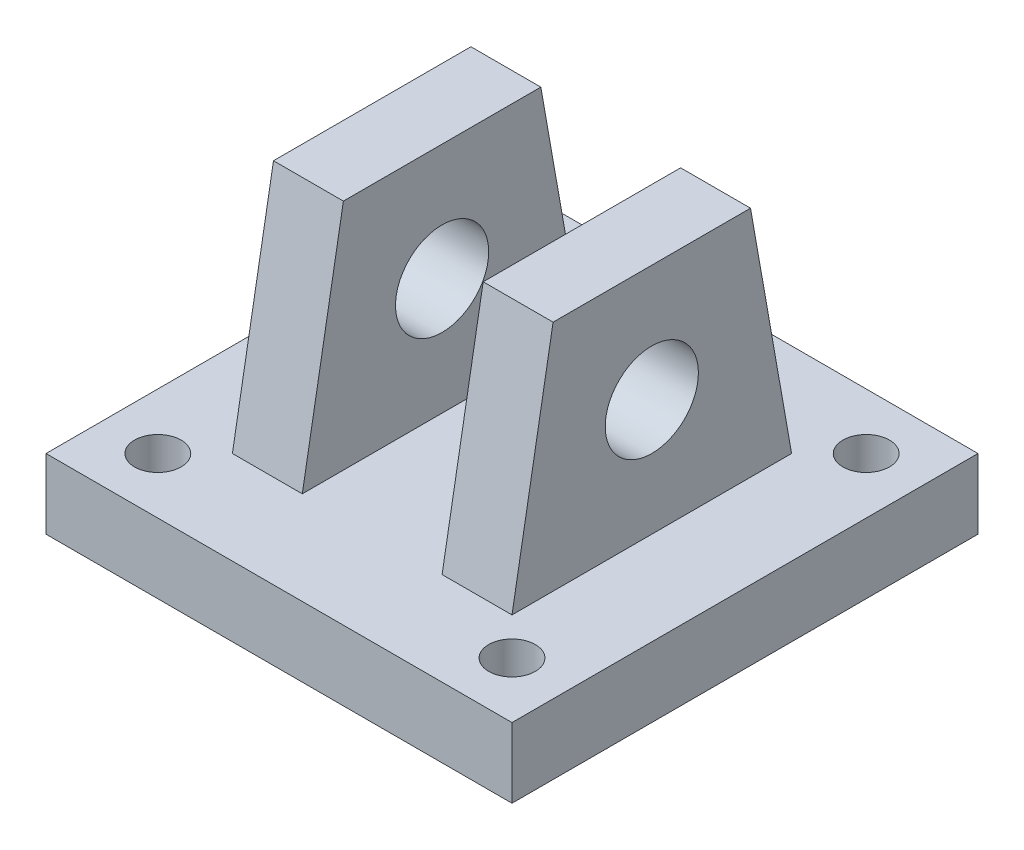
from build123d import *

# Parameters (mm, degrees)
SKETCH1_W          = 127
SKETCH1_H          = 127
EXTRUDE1_DEPTH     = 19.05
EXTRUDE2_DEPTH     = 38.1
SKETCH3_R          = 12.7
CUT_EXTRUDE1_DEPTH = 38.1
SKETCH4_W          = 38.1
SKETCH4_H          = 63.5
CUT_EXTRUDE2_DEPTH = 38.1
CUT_EXTRUDE3_REACH = 111.985
SKETCH5_R          = 6.35
CUT_EXTRUDE4_REACH = 111.985
SKETCH6_R          = 6.35
CUT_EXTRUDE5_REACH = 111.985
SKETCH8_R          = 6.35


with BuildPart() as part:
    # Sketch1 → Extrude1 (new body)
    with BuildSketch(Plane(origin=(0, 0, 0), x_dir=(1, 0, 0), z_dir=(0, 1, 0))):
        Rectangle(SKETCH1_W, SKETCH1_H)
    extrude(amount=-EXTRUDE1_DEPTH)

    # Sketch2 → Extrude2 (add, symmetric)
    with BuildSketch(Plane(origin=(0, 0, 0), x_dir=(0, 0, -1), z_dir=(1, 0, 0))):
        Polygon((38.1, 0), (26.903236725, 63.5), (-26.903236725, 63.5), (-38.1, 0), align=None)
    extrude(amount=EXTRUDE2_DEPTH, both=True)

    # Sketch3 → Cut-Extrude1 (cut, symmetric)
    with BuildSketch(Plane(origin=(0, 0, 0), x_dir=(0, 0, -1), z_dir=(1, 0, 0))):
        with Locations((0, 31.75)):
            Circle(SKETCH3_R)
    extrude(amount=CUT_EXTRUDE1_DEPTH, both=True, mode=Mode.SUBTRACT)

    # Sketch4 → Cut-Extrude2 (cut, symmetric)
    with BuildSketch(Plane.XY):
        with Locations((0, 31.75)):
            Rectangle(SKETCH4_W, SKETCH4_H)
    extrude(amount=CUT_EXTRUDE2_DEPTH, both=True, mode=Mode.SUBTRACT)

    # Sketch5 → Cut-Extrude3 (cut, up to next)
    with BuildSketch(Plane(origin=(0, 0, 0), x_dir=(1, 0, 0), z_dir=(0, 1, 0)), mode=Mode.PRIVATE) as cut_extrude3_sk1:
        with Locations(Location((-48.26, 48.26, 0), (0, 0, 270))):
            Circle(SKETCH5_R)
    cut_extrude3_tool1 = extrude(cut_extrude3_sk1.sketch, amount=-CUT_EXTRUDE3_REACH, mode=Mode.PRIVATE) & part.part
    add(cut_extrude3_tool1.solids().sort_by_distance((-48.26, 0, -48.26))[0], mode=Mode.SUBTRACT)

    # Sketch6 → Cut-Extrude4 (cut, up to next)
    with BuildSketch(Plane(origin=(0, 0, 0), x_dir=(1, 0, 0), z_dir=(0, 1, 0)), mode=Mode.PRIVATE) as cut_extrude4_sk1:
        with Locations(Location((48.26, 48.26, 0), (0, 0, 270))):
            Circle(SKETCH6_R)
    cut_extrude4_tool1 = extrude(cut_extrude4_sk1.sketch, amount=-CUT_EXTRUDE4_REACH, mode=Mode.PRIVATE) & part.part
    add(cut_extrude4_tool1.solids().sort_by_distance((48.26, 0, -48.26))[0], mode=Mode.SUBTRACT)

    # Sketch8 → Cut-Extrude5 (cut, up to next)
    with BuildSketch(Plane(origin=(0, 0, 0), x_dir=(1, 0, 0), z_dir=(0, 1, 0)), mode=Mode.PRIVATE) as cut_extrude5_sk1:
        with Locations(Location((-48.26, -48.26, 0), (0, 0, 270))):
            Circle(SKETCH8_R)
    cut_extrude5_tool1 = extrude(cut_extrude5_sk1.sketch, amount=-CUT_EXTRUDE5_REACH, mode=Mode.PRIVATE) & part.part
    # Sketch8 → Cut-Extrude5 (cut, up to next)
    with BuildSketch(Plane(origin=(0, 0, 0), x_dir=(1, 0, 0), z_dir=(0, 1, 0)), mode=Mode.PRIVATE) as cut_extrude5_sk2:
        with Locations(Location((48.26, -48.26, 0), (0, 0, 270))):
            Circle(SKETCH8_R)
    cut_extrude5_tool2 = extrude(cut_extrude5_sk2.sketch, amount=-CUT_EXTRUDE5_REACH, mode=Mode.PRIVATE) & part.part
    add(cut_extrude5_tool1.solids().sort_by_distance((-48.26, 0, 48.26))[0], mode=Mode.SUBTRACT)
    add(cut_extrude5_tool2.solids().sort_by_distance((48.26, 0, 48.26))[0], mode=Mode.SUBTRACT)


solid = part.part
